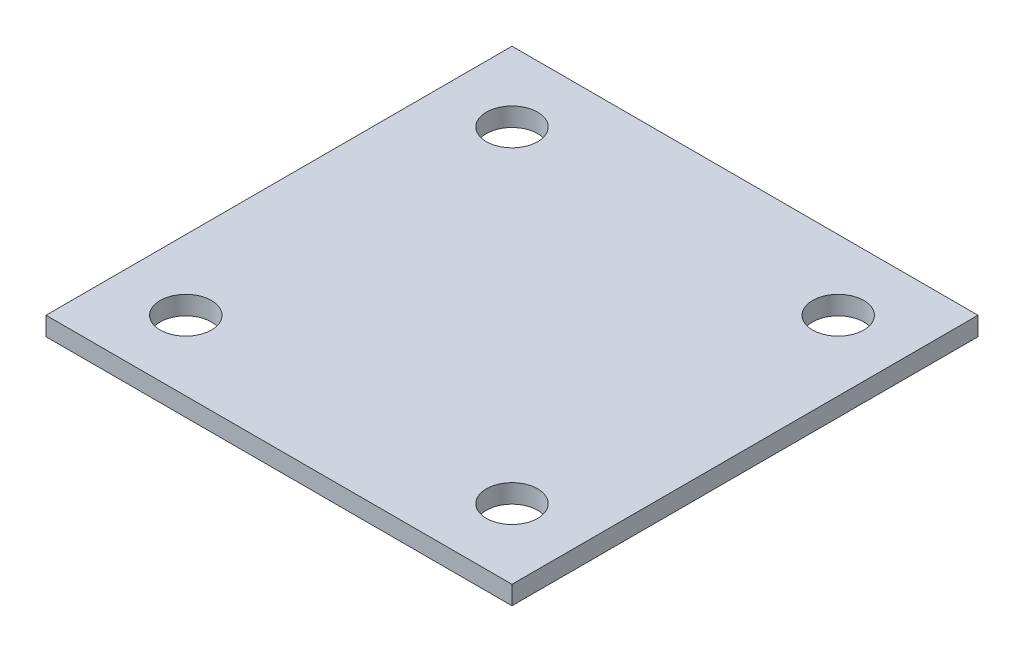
from build123d import *

# Parameters (mm, degrees)
SKETCH_1_W                   = 100
SKETCH_1_H                   = 100
SKETCH_1_R                   = 5.5
EXTRUDE_100_100_4_4_11_DEPTH = 4


with BuildPart() as part:
    # Sketch 1 → Extrude 100_100_4_ 4 _. _11 (new body)
    with BuildSketch(Plane(origin=(0, 0, 0), x_dir=(1, 0, 0), z_dir=(0, 1, 0))):
        Rectangle(SKETCH_1_W, SKETCH_1_H)
        with Locations(Location((-35, -35, 0), (0, 0, 270))):
            Circle(SKETCH_1_R, mode=Mode.SUBTRACT)
        with Locations(Location((-35, 35, 0), (0, 0, 270))):
            Circle(SKETCH_1_R, mode=Mode.SUBTRACT)
        with Locations(Location((35, -35, 0), (0, 0, 270))):
            Circle(SKETCH_1_R, mode=Mode.SUBTRACT)
        with Locations(Location((35, 35, 0), (0, 0, 270))):
            Circle(SKETCH_1_R, mode=Mode.SUBTRACT)
    extrude(amount=EXTRUDE_100_100_4_4_11_DEPTH)


solid = part.part
